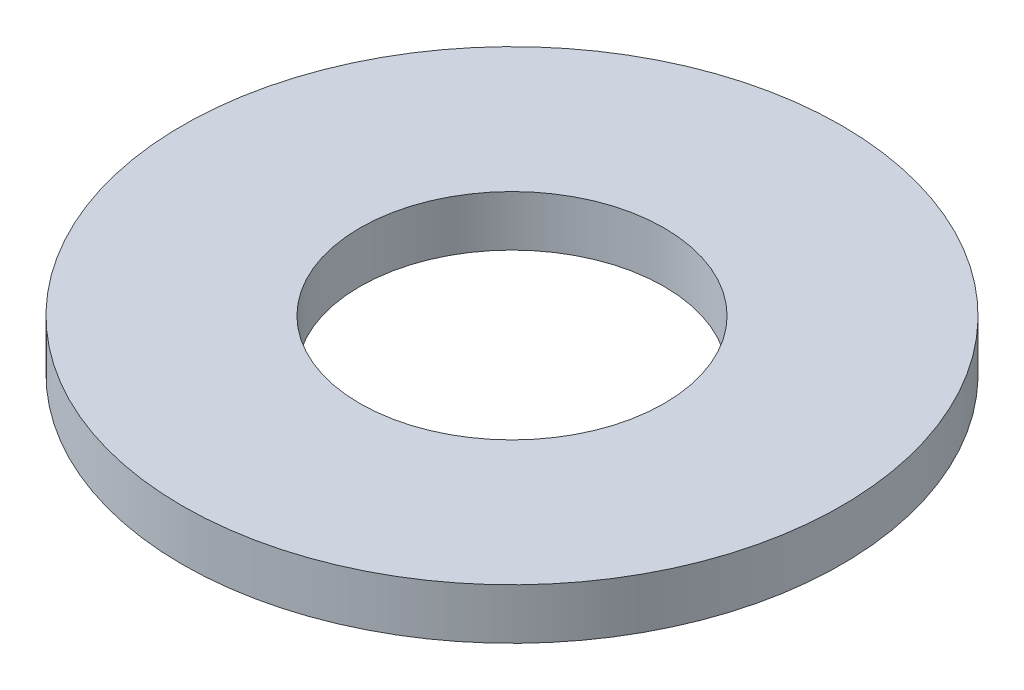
from build123d import *

# Parameters (mm, degrees)
SKETCH_1_R      = 6.5
SKETCH_1_R_2    = 3
EXTRUDE_1_DEPTH = 1


with BuildPart() as part:
    # Sketch 1 → Extrude 1 (new body)
    with BuildSketch(Plane(origin=(0, 0, 0), x_dir=(1, 0, 0), z_dir=(0, 1, 0))):
        with Locations(Location((0, 0, 0), (0, 0, 270))):
            Circle(SKETCH_1_R)
        with Locations(Location((0, 0, 0), (0, 0, 270))):
            Circle(SKETCH_1_R_2, mode=Mode.SUBTRACT)
    extrude(amount=EXTRUDE_1_DEPTH)


solid = part.part
